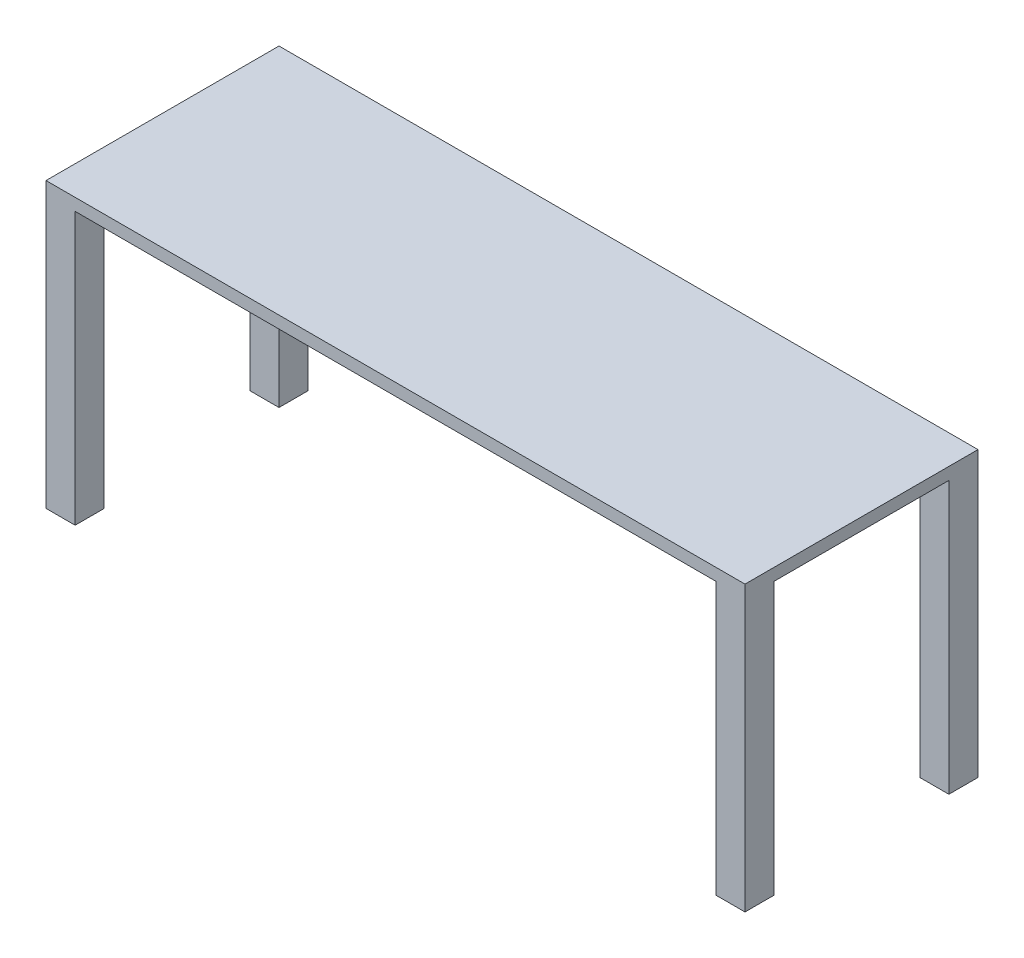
ISO-10303-21;
HEADER;
FILE_DESCRIPTION(('STEP AP214'),'2;1');
FILE_NAME('part.step','',(''),(''),'','','');
FILE_SCHEMA(('AUTOMOTIVE_DESIGN { 1 0 10303 214 1 1 1 1 }'));
ENDSEC;
DATA;
#1=APPLICATION_CONTEXT('core data for automotive mechanical design processes');
#2=APPLICATION_PROTOCOL_DEFINITION('international standard','automotive_design',2000,#1);
#3=PRODUCT_CONTEXT('',#1,'mechanical');
#4=PRODUCT('Part','Part','',(#3));
#5=PRODUCT_RELATED_PRODUCT_CATEGORY('part','',(#4));
#6=PRODUCT_DEFINITION_FORMATION('','',#4);
#7=PRODUCT_DEFINITION_CONTEXT('part definition',#1,'design');
#8=PRODUCT_DEFINITION('design','',#6,#7);
#9=PRODUCT_DEFINITION_SHAPE('','',#8);
#10=(LENGTH_UNIT() NAMED_UNIT(*) SI_UNIT(.MILLI.,.METRE.));
#11=(NAMED_UNIT(*) PLANE_ANGLE_UNIT() SI_UNIT($,.RADIAN.));
#12=(NAMED_UNIT(*) SI_UNIT($,.STERADIAN.) SOLID_ANGLE_UNIT());
#13=UNCERTAINTY_MEASURE_WITH_UNIT(LENGTH_MEASURE(1.E-05),#10,'distance_accuracy_value','');
#14=(GEOMETRIC_REPRESENTATION_CONTEXT(3) GLOBAL_UNCERTAINTY_ASSIGNED_CONTEXT((#13)) GLOBAL_UNIT_ASSIGNED_CONTEXT((#10,
#11,#12)) REPRESENTATION_CONTEXT('',''));
#15=CARTESIAN_POINT('',(0.,0.,0.));
#16=DIRECTION('',(0.,0.,1.));
#17=DIRECTION('',(1.,0.,0.));
#18=AXIS2_PLACEMENT_3D('',#15,#16,#17);
#19=CARTESIAN_POINT('',(0.,0.,0.));
#20=DIRECTION('',(0.,1.,0.));
#21=DIRECTION('',(0.,0.,1.));
#22=AXIS2_PLACEMENT_3D('',#19,#20,#21);
#23=PLANE('',#22);
#24=DIRECTION('',(-1.,0.,0.));
#25=VECTOR('',#24,1.);
#26=CARTESIAN_POINT('',(1828.8,0.,-533.399999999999));
#27=LINE('',#26,#25);
#28=CARTESIAN_POINT('',(1828.8,0.,-533.399999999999));
#29=VERTEX_POINT('',#28);
#30=CARTESIAN_POINT('',(1752.6,0.,-533.399999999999));
#31=VERTEX_POINT('',#30);
#32=EDGE_CURVE('E153',#29,#31,#27,.T.);
#33=ORIENTED_EDGE('',*,*,#32,.F.);
#34=DIRECTION('',(0.,0.,-1.));
#35=VECTOR('',#34,1.);
#36=CARTESIAN_POINT('',(1828.8,0.,-609.6));
#37=LINE('',#36,#35);
#38=CARTESIAN_POINT('',(1828.8,0.,-76.1999999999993));
#39=VERTEX_POINT('',#38);
#40=EDGE_CURVE('E162',#39,#29,#37,.T.);
#41=ORIENTED_EDGE('',*,*,#40,.F.);
#42=DIRECTION('',(-1.,0.,0.));
#43=VECTOR('',#42,1.);
#44=CARTESIAN_POINT('',(1828.8,0.,-76.199999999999));
#45=LINE('',#44,#43);
#46=CARTESIAN_POINT('',(1752.6,0.,-76.199999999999));
#47=VERTEX_POINT('',#46);
#48=EDGE_CURVE('E59',#39,#47,#45,.T.);
#49=ORIENTED_EDGE('',*,*,#48,.T.);
#50=DIRECTION('',(0.,0.,-1.));
#51=VECTOR('',#50,1.);
#52=CARTESIAN_POINT('',(1752.6,0.,9.15933995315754E-13));
#53=LINE('',#52,#51);
#54=CARTESIAN_POINT('',(1752.6,0.,9.15933995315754E-13));
#55=VERTEX_POINT('',#54);
#56=EDGE_CURVE('E203',#55,#47,#53,.T.);
#57=ORIENTED_EDGE('',*,*,#56,.F.);
#58=DIRECTION('',(1.,0.,0.));
#59=VECTOR('',#58,1.);
#60=CARTESIAN_POINT('',(0.,0.,0.));
#61=LINE('',#60,#59);
#62=CARTESIAN_POINT('',(76.2,0.,0.));
#63=VERTEX_POINT('',#62);
#64=EDGE_CURVE('E170',#63,#55,#61,.T.);
#65=ORIENTED_EDGE('',*,*,#64,.F.);
#66=DIRECTION('',(0.,0.,-1.));
#67=VECTOR('',#66,1.);
#68=CARTESIAN_POINT('',(76.2,0.,0.));
#69=LINE('',#68,#67);
#70=CARTESIAN_POINT('',(76.2,0.,-76.2));
#71=VERTEX_POINT('',#70);
#72=EDGE_CURVE('E237',#63,#71,#69,.T.);
#73=ORIENTED_EDGE('',*,*,#72,.T.);
#74=DIRECTION('',(1.,0.,0.));
#75=VECTOR('',#74,1.);
#76=CARTESIAN_POINT('',(0.,0.,-76.2));
#77=LINE('',#76,#75);
#78=CARTESIAN_POINT('',(0.,0.,-76.2));
#79=VERTEX_POINT('',#78);
#80=EDGE_CURVE('E225',#79,#71,#77,.T.);
#81=ORIENTED_EDGE('',*,*,#80,.F.);
#82=DIRECTION('',(0.,0.,1.));
#83=VECTOR('',#82,1.);
#84=CARTESIAN_POINT('',(0.,0.,-609.6));
#85=LINE('',#84,#83);
#86=CARTESIAN_POINT('',(0.,0.,-533.4));
#87=VERTEX_POINT('',#86);
#88=EDGE_CURVE('E175',#87,#79,#85,.T.);
#89=ORIENTED_EDGE('',*,*,#88,.F.);
#90=DIRECTION('',(1.,0.,0.));
#91=VECTOR('',#90,1.);
#92=CARTESIAN_POINT('',(0.,0.,-533.4));
#93=LINE('',#92,#91);
#94=CARTESIAN_POINT('',(76.2,0.,-533.4));
#95=VERTEX_POINT('',#94);
#96=EDGE_CURVE('E221',#87,#95,#93,.T.);
#97=ORIENTED_EDGE('',*,*,#96,.T.);
#98=DIRECTION('',(0.,0.,1.));
#99=VECTOR('',#98,1.);
#100=CARTESIAN_POINT('',(76.2,0.,-609.6));
#101=LINE('',#100,#99);
#102=CARTESIAN_POINT('',(76.2,0.,-609.6));
#103=VERTEX_POINT('',#102);
#104=EDGE_CURVE('E218',#103,#95,#101,.T.);
#105=ORIENTED_EDGE('',*,*,#104,.F.);
#106=DIRECTION('',(-1.,0.,0.));
#107=VECTOR('',#106,1.);
#108=CARTESIAN_POINT('',(0.,0.,-609.6));
#109=LINE('',#108,#107);
#110=CARTESIAN_POINT('',(1752.6,0.,-609.6));
#111=VERTEX_POINT('',#110);
#112=EDGE_CURVE('E169',#111,#103,#109,.T.);
#113=ORIENTED_EDGE('',*,*,#112,.F.);
#114=DIRECTION('',(0.,0.,1.));
#115=VECTOR('',#114,1.);
#116=CARTESIAN_POINT('',(1752.6,0.,-609.599999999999));
#117=LINE('',#116,#115);
#118=EDGE_CURVE('E51',#111,#31,#117,.T.);
#119=ORIENTED_EDGE('',*,*,#118,.T.);
#120=EDGE_LOOP('',(#33,#41,#49,#57,#65,#73,#81,#89,#97,#105,#113,#119));
#121=FACE_BOUND('',#120,.T.);
#122=ADVANCED_FACE('F36',(#121),#23,.F.);
#123=CARTESIAN_POINT('',(0.,31.75,-609.6));
#124=DIRECTION('',(1.,0.,0.));
#125=DIRECTION('',(0.,0.,-1.));
#126=AXIS2_PLACEMENT_3D('',#123,#124,#125);
#127=PLANE('',#126);
#128=DIRECTION('',(0.,-1.,0.));
#129=VECTOR('',#128,1.);
#130=CARTESIAN_POINT('',(0.,31.75,-609.6));
#131=LINE('',#130,#129);
#132=CARTESIAN_POINT('',(0.,31.75,-609.6));
#133=VERTEX_POINT('',#132);
#134=CARTESIAN_POINT('',(0.,-711.2,-609.6));
#135=VERTEX_POINT('',#134);
#136=EDGE_CURVE('E179',#133,#135,#131,.T.);
#137=ORIENTED_EDGE('',*,*,#136,.T.);
#138=DIRECTION('',(0.,0.,1.));
#139=VECTOR('',#138,1.);
#140=CARTESIAN_POINT('',(0.,-711.2,-609.6));
#141=LINE('',#140,#139);
#142=CARTESIAN_POINT('',(0.,-711.2,-533.4));
#143=VERTEX_POINT('',#142);
#144=EDGE_CURVE('E222',#135,#143,#141,.T.);
#145=ORIENTED_EDGE('',*,*,#144,.T.);
#146=DIRECTION('',(0.,1.,0.));
#147=VECTOR('',#146,1.);
#148=CARTESIAN_POINT('',(0.,-711.2,-533.4));
#149=LINE('',#148,#147);
#150=EDGE_CURVE('E210',#143,#87,#149,.T.);
#151=ORIENTED_EDGE('',*,*,#150,.T.);
#152=ORIENTED_EDGE('',*,*,#88,.T.);
#153=DIRECTION('',(0.,1.,0.));
#154=VECTOR('',#153,1.);
#155=CARTESIAN_POINT('',(0.,-711.2,-76.2));
#156=LINE('',#155,#154);
#157=CARTESIAN_POINT('',(0.,-711.2,-76.2));
#158=VERTEX_POINT('',#157);
#159=EDGE_CURVE('E245',#158,#79,#156,.T.);
#160=ORIENTED_EDGE('',*,*,#159,.F.);
#161=DIRECTION('',(0.,0.,-1.));
#162=VECTOR('',#161,1.);
#163=CARTESIAN_POINT('',(0.,-711.2,0.));
#164=LINE('',#163,#162);
#165=CARTESIAN_POINT('',(0.,-711.2,0.));
#166=VERTEX_POINT('',#165);
#167=EDGE_CURVE('E243',#166,#158,#164,.T.);
#168=ORIENTED_EDGE('',*,*,#167,.F.);
#169=DIRECTION('',(0.,-1.,0.));
#170=VECTOR('',#169,1.);
#171=CARTESIAN_POINT('',(0.,31.75,0.));
#172=LINE('',#171,#170);
#173=CARTESIAN_POINT('',(0.,31.75,0.));
#174=VERTEX_POINT('',#173);
#175=EDGE_CURVE('E11',#174,#166,#172,.T.);
#176=ORIENTED_EDGE('',*,*,#175,.F.);
#177=DIRECTION('',(0.,0.,1.));
#178=VECTOR('',#177,1.);
#179=CARTESIAN_POINT('',(0.,31.75,-609.6));
#180=LINE('',#179,#178);
#181=EDGE_CURVE('E172',#133,#174,#180,.T.);
#182=ORIENTED_EDGE('',*,*,#181,.F.);
#183=EDGE_LOOP('',(#137,#145,#151,#152,#160,#168,#176,#182));
#184=FACE_BOUND('',#183,.T.);
#185=ADVANCED_FACE('F38',(#184),#127,.F.);
#186=CARTESIAN_POINT('',(0.,31.75,0.));
#187=DIRECTION('',(0.,0.,-1.));
#188=DIRECTION('',(-1.,0.,0.));
#189=AXIS2_PLACEMENT_3D('',#186,#187,#188);
#190=PLANE('',#189);
#191=ORIENTED_EDGE('',*,*,#175,.T.);
#192=DIRECTION('',(1.,0.,0.));
#193=VECTOR('',#192,1.);
#194=CARTESIAN_POINT('',(0.,-711.2,0.));
#195=LINE('',#194,#193);
#196=CARTESIAN_POINT('',(76.2,-711.2,0.));
#197=VERTEX_POINT('',#196);
#198=EDGE_CURVE('E240',#166,#197,#195,.T.);
#199=ORIENTED_EDGE('',*,*,#198,.T.);
#200=DIRECTION('',(0.,1.,0.));
#201=VECTOR('',#200,1.);
#202=CARTESIAN_POINT('',(76.2,-711.2,0.));
#203=LINE('',#202,#201);
#204=EDGE_CURVE('E251',#197,#63,#203,.T.);
#205=ORIENTED_EDGE('',*,*,#204,.T.);
#206=ORIENTED_EDGE('',*,*,#64,.T.);
#207=DIRECTION('',(0.,1.,0.));
#208=VECTOR('',#207,1.);
#209=CARTESIAN_POINT('',(1752.6,-711.2,9.15933995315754E-13));
#210=LINE('',#209,#208);
#211=CARTESIAN_POINT('',(1752.6,-711.2,9.15933995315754E-13));
#212=VERTEX_POINT('',#211);
#213=EDGE_CURVE('E194',#212,#55,#210,.T.);
#214=ORIENTED_EDGE('',*,*,#213,.F.);
#215=DIRECTION('',(-1.,0.,0.));
#216=VECTOR('',#215,1.);
#217=CARTESIAN_POINT('',(1828.8,-711.2,9.9920072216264E-13));
#218=LINE('',#217,#216);
#219=CARTESIAN_POINT('',(1828.8,-711.2,9.9920072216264E-13));
#220=VERTEX_POINT('',#219);
#221=EDGE_CURVE('E192',#220,#212,#218,.T.);
#222=ORIENTED_EDGE('',*,*,#221,.F.);
#223=DIRECTION('',(0.,-1.,0.));
#224=VECTOR('',#223,1.);
#225=CARTESIAN_POINT('',(1828.8,31.75,0.));
#226=LINE('',#225,#224);
#227=CARTESIAN_POINT('',(1828.8,31.75,0.));
#228=VERTEX_POINT('',#227);
#229=EDGE_CURVE('E44',#228,#220,#226,.T.);
#230=ORIENTED_EDGE('',*,*,#229,.F.);
#231=DIRECTION('',(1.,0.,0.));
#232=VECTOR('',#231,1.);
#233=CARTESIAN_POINT('',(0.,31.75,0.));
#234=LINE('',#233,#232);
#235=EDGE_CURVE('E258',#174,#228,#234,.T.);
#236=ORIENTED_EDGE('',*,*,#235,.F.);
#237=EDGE_LOOP('',(#191,#199,#205,#206,#214,#222,#230,#236));
#238=FACE_BOUND('',#237,.T.);
#239=ADVANCED_FACE('F193',(#238),#190,.F.);
#240=CARTESIAN_POINT('',(1828.8,31.75,-609.6));
#241=DIRECTION('',(-1.,0.,0.));
#242=DIRECTION('',(0.,0.,1.));
#243=AXIS2_PLACEMENT_3D('',#240,#241,#242);
#244=PLANE('',#243);
#245=ORIENTED_EDGE('',*,*,#229,.T.);
#246=DIRECTION('',(0.,0.,-1.));
#247=VECTOR('',#246,1.);
#248=CARTESIAN_POINT('',(1828.8,-711.2,9.9920072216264E-13));
#249=LINE('',#248,#247);
#250=CARTESIAN_POINT('',(1828.8,-711.2,-76.199999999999));
#251=VERTEX_POINT('',#250);
#252=EDGE_CURVE('E187',#220,#251,#249,.T.);
#253=ORIENTED_EDGE('',*,*,#252,.T.);
#254=DIRECTION('',(0.,1.,0.));
#255=VECTOR('',#254,1.);
#256=CARTESIAN_POINT('',(1828.8,-711.2,-76.199999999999));
#257=LINE('',#256,#255);
#258=EDGE_CURVE('E168',#251,#39,#257,.T.);
#259=ORIENTED_EDGE('',*,*,#258,.T.);
#260=ORIENTED_EDGE('',*,*,#40,.T.);
#261=DIRECTION('',(0.,1.,0.));
#262=VECTOR('',#261,1.);
#263=CARTESIAN_POINT('',(1828.8,-711.2,-533.399999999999));
#264=LINE('',#263,#262);
#265=CARTESIAN_POINT('',(1828.8,-711.2,-533.399999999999));
#266=VERTEX_POINT('',#265);
#267=EDGE_CURVE('E149',#266,#29,#264,.T.);
#268=ORIENTED_EDGE('',*,*,#267,.F.);
#269=DIRECTION('',(0.,0.,1.));
#270=VECTOR('',#269,1.);
#271=CARTESIAN_POINT('',(1828.8,-711.2,-609.599999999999));
#272=LINE('',#271,#270);
#273=CARTESIAN_POINT('',(1828.8,-711.2,-609.599999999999));
#274=VERTEX_POINT('',#273);
#275=EDGE_CURVE('E432',#274,#266,#272,.T.);
#276=ORIENTED_EDGE('',*,*,#275,.F.);
#277=DIRECTION('',(0.,-1.,0.));
#278=VECTOR('',#277,1.);
#279=CARTESIAN_POINT('',(1828.8,31.75,-609.6));
#280=LINE('',#279,#278);
#281=CARTESIAN_POINT('',(1828.8,31.75,-609.6));
#282=VERTEX_POINT('',#281);
#283=EDGE_CURVE('E181',#282,#274,#280,.T.);
#284=ORIENTED_EDGE('',*,*,#283,.F.);
#285=DIRECTION('',(0.,0.,-1.));
#286=VECTOR('',#285,1.);
#287=CARTESIAN_POINT('',(1828.8,31.75,-609.6));
#288=LINE('',#287,#286);
#289=EDGE_CURVE('E189',#228,#282,#288,.T.);
#290=ORIENTED_EDGE('',*,*,#289,.F.);
#291=EDGE_LOOP('',(#245,#253,#259,#260,#268,#276,#284,#290));
#292=FACE_BOUND('',#291,.T.);
#293=ADVANCED_FACE('F166',(#292),#244,.F.);
#294=CARTESIAN_POINT('',(0.,31.75,-609.6));
#295=DIRECTION('',(0.,0.,1.));
#296=DIRECTION('',(1.,0.,0.));
#297=AXIS2_PLACEMENT_3D('',#294,#295,#296);
#298=PLANE('',#297);
#299=ORIENTED_EDGE('',*,*,#283,.T.);
#300=DIRECTION('',(-1.,0.,0.));
#301=VECTOR('',#300,1.);
#302=CARTESIAN_POINT('',(1828.8,-711.2,-609.599999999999));
#303=LINE('',#302,#301);
#304=CARTESIAN_POINT('',(1752.6,-711.2,-609.599999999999));
#305=VERTEX_POINT('',#304);
#306=EDGE_CURVE('E164',#274,#305,#303,.T.);
#307=ORIENTED_EDGE('',*,*,#306,.T.);
#308=DIRECTION('',(0.,1.,0.));
#309=VECTOR('',#308,1.);
#310=CARTESIAN_POINT('',(1752.6,-711.2,-609.599999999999));
#311=LINE('',#310,#309);
#312=EDGE_CURVE('E446',#305,#111,#311,.T.);
#313=ORIENTED_EDGE('',*,*,#312,.T.);
#314=ORIENTED_EDGE('',*,*,#112,.T.);
#315=DIRECTION('',(0.,1.,0.));
#316=VECTOR('',#315,1.);
#317=CARTESIAN_POINT('',(76.2,-711.2,-609.6));
#318=LINE('',#317,#316);
#319=CARTESIAN_POINT('',(76.2,-711.2,-609.6));
#320=VERTEX_POINT('',#319);
#321=EDGE_CURVE('E215',#320,#103,#318,.T.);
#322=ORIENTED_EDGE('',*,*,#321,.F.);
#323=DIRECTION('',(1.,0.,0.));
#324=VECTOR('',#323,1.);
#325=CARTESIAN_POINT('',(0.,-711.2,-609.6));
#326=LINE('',#325,#324);
#327=EDGE_CURVE('E212',#135,#320,#326,.T.);
#328=ORIENTED_EDGE('',*,*,#327,.F.);
#329=ORIENTED_EDGE('',*,*,#136,.F.);
#330=DIRECTION('',(-1.,0.,0.));
#331=VECTOR('',#330,1.);
#332=CARTESIAN_POINT('',(0.,31.75,-609.6));
#333=LINE('',#332,#331);
#334=EDGE_CURVE('E182',#282,#133,#333,.T.);
#335=ORIENTED_EDGE('',*,*,#334,.F.);
#336=EDGE_LOOP('',(#299,#307,#313,#314,#322,#328,#329,#335));
#337=FACE_BOUND('',#336,.T.);
#338=ADVANCED_FACE('F288',(#337),#298,.F.);
#339=CARTESIAN_POINT('',(0.,31.75,0.));
#340=DIRECTION('',(0.,1.,0.));
#341=DIRECTION('',(0.,0.,1.));
#342=AXIS2_PLACEMENT_3D('',#339,#340,#341);
#343=PLANE('',#342);
#344=ORIENTED_EDGE('',*,*,#181,.T.);
#345=ORIENTED_EDGE('',*,*,#235,.T.);
#346=ORIENTED_EDGE('',*,*,#289,.T.);
#347=ORIENTED_EDGE('',*,*,#334,.T.);
#348=EDGE_LOOP('',(#344,#345,#346,#347));
#349=FACE_BOUND('',#348,.T.);
#350=ADVANCED_FACE('F285',(#349),#343,.T.);
#351=CARTESIAN_POINT('',(0.,-711.2,-76.2));
#352=DIRECTION('',(0.,0.,1.));
#353=DIRECTION('',(1.,0.,0.));
#354=AXIS2_PLACEMENT_3D('',#351,#352,#353);
#355=PLANE('',#354);
#356=ORIENTED_EDGE('',*,*,#80,.T.);
#357=DIRECTION('',(0.,1.,0.));
#358=VECTOR('',#357,1.);
#359=CARTESIAN_POINT('',(76.2,-711.2,-76.2));
#360=LINE('',#359,#358);
#361=CARTESIAN_POINT('',(76.2,-711.2,-76.2));
#362=VERTEX_POINT('',#361);
#363=EDGE_CURVE('E253',#362,#71,#360,.T.);
#364=ORIENTED_EDGE('',*,*,#363,.F.);
#365=DIRECTION('',(1.,0.,0.));
#366=VECTOR('',#365,1.);
#367=CARTESIAN_POINT('',(0.,-711.2,-76.2));
#368=LINE('',#367,#366);
#369=EDGE_CURVE('E234',#158,#362,#368,.T.);
#370=ORIENTED_EDGE('',*,*,#369,.F.);
#371=ORIENTED_EDGE('',*,*,#159,.T.);
#372=EDGE_LOOP('',(#356,#364,#370,#371));
#373=FACE_BOUND('',#372,.T.);
#374=ADVANCED_FACE('F269',(#373),#355,.F.);
#375=CARTESIAN_POINT('',(76.2,-711.2,0.));
#376=DIRECTION('',(1.,0.,0.));
#377=DIRECTION('',(0.,0.,-1.));
#378=AXIS2_PLACEMENT_3D('',#375,#376,#377);
#379=PLANE('',#378);
#380=ORIENTED_EDGE('',*,*,#72,.F.);
#381=ORIENTED_EDGE('',*,*,#204,.F.);
#382=DIRECTION('',(0.,0.,-1.));
#383=VECTOR('',#382,1.);
#384=CARTESIAN_POINT('',(76.2,-711.2,0.));
#385=LINE('',#384,#383);
#386=EDGE_CURVE('E236',#197,#362,#385,.T.);
#387=ORIENTED_EDGE('',*,*,#386,.T.);
#388=ORIENTED_EDGE('',*,*,#363,.T.);
#389=EDGE_LOOP('',(#380,#381,#387,#388));
#390=FACE_BOUND('',#389,.T.);
#391=ADVANCED_FACE('F275',(#390),#379,.T.);
#392=CARTESIAN_POINT('',(0.,-711.2,0.));
#393=DIRECTION('',(0.,1.,0.));
#394=DIRECTION('',(0.,0.,1.));
#395=AXIS2_PLACEMENT_3D('',#392,#393,#394);
#396=PLANE('',#395);
#397=ORIENTED_EDGE('',*,*,#369,.T.);
#398=ORIENTED_EDGE('',*,*,#386,.F.);
#399=ORIENTED_EDGE('',*,*,#198,.F.);
#400=ORIENTED_EDGE('',*,*,#167,.T.);
#401=EDGE_LOOP('',(#397,#398,#399,#400));
#402=FACE_BOUND('',#401,.T.);
#403=ADVANCED_FACE('F279',(#402),#396,.F.);
#404=CARTESIAN_POINT('',(76.2,-711.2,-609.6));
#405=DIRECTION('',(-1.,0.,0.));
#406=DIRECTION('',(0.,0.,1.));
#407=AXIS2_PLACEMENT_3D('',#404,#405,#406);
#408=PLANE('',#407);
#409=ORIENTED_EDGE('',*,*,#104,.T.);
#410=DIRECTION('',(0.,1.,0.));
#411=VECTOR('',#410,1.);
#412=CARTESIAN_POINT('',(76.2,-711.2,-533.4));
#413=LINE('',#412,#411);
#414=CARTESIAN_POINT('',(76.2,-711.2,-533.4));
#415=VERTEX_POINT('',#414);
#416=EDGE_CURVE('E213',#415,#95,#413,.T.);
#417=ORIENTED_EDGE('',*,*,#416,.F.);
#418=DIRECTION('',(0.,0.,1.));
#419=VECTOR('',#418,1.);
#420=CARTESIAN_POINT('',(76.2,-711.2,-609.6));
#421=LINE('',#420,#419);
#422=EDGE_CURVE('E227',#320,#415,#421,.T.);
#423=ORIENTED_EDGE('',*,*,#422,.F.);
#424=ORIENTED_EDGE('',*,*,#321,.T.);
#425=EDGE_LOOP('',(#409,#417,#423,#424));
#426=FACE_BOUND('',#425,.T.);
#427=ADVANCED_FACE('F300',(#426),#408,.F.);
#428=CARTESIAN_POINT('',(0.,-711.2,-533.4));
#429=DIRECTION('',(0.,0.,1.));
#430=DIRECTION('',(1.,0.,0.));
#431=AXIS2_PLACEMENT_3D('',#428,#429,#430);
#432=PLANE('',#431);
#433=ORIENTED_EDGE('',*,*,#96,.F.);
#434=ORIENTED_EDGE('',*,*,#150,.F.);
#435=DIRECTION('',(1.,0.,0.));
#436=VECTOR('',#435,1.);
#437=CARTESIAN_POINT('',(0.,-711.2,-533.4));
#438=LINE('',#437,#436);
#439=EDGE_CURVE('E229',#143,#415,#438,.T.);
#440=ORIENTED_EDGE('',*,*,#439,.T.);
#441=ORIENTED_EDGE('',*,*,#416,.T.);
#442=EDGE_LOOP('',(#433,#434,#440,#441));
#443=FACE_BOUND('',#442,.T.);
#444=ADVANCED_FACE('F297',(#443),#432,.T.);
#445=CARTESIAN_POINT('',(0.,-711.2,0.));
#446=DIRECTION('',(0.,1.,0.));
#447=DIRECTION('',(0.,0.,1.));
#448=AXIS2_PLACEMENT_3D('',#445,#446,#447);
#449=PLANE('',#448);
#450=ORIENTED_EDGE('',*,*,#144,.F.);
#451=ORIENTED_EDGE('',*,*,#327,.T.);
#452=ORIENTED_EDGE('',*,*,#422,.T.);
#453=ORIENTED_EDGE('',*,*,#439,.F.);
#454=EDGE_LOOP('',(#450,#451,#452,#453));
#455=FACE_BOUND('',#454,.T.);
#456=ADVANCED_FACE('F294',(#455),#449,.F.);
#457=CARTESIAN_POINT('',(1752.6,-711.2,9.15933995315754E-13));
#458=DIRECTION('',(1.,0.,0.));
#459=DIRECTION('',(0.,0.,-1.));
#460=AXIS2_PLACEMENT_3D('',#457,#458,#459);
#461=PLANE('',#460);
#462=ORIENTED_EDGE('',*,*,#56,.T.);
#463=DIRECTION('',(0.,1.,0.));
#464=VECTOR('',#463,1.);
#465=CARTESIAN_POINT('',(1752.6,-711.2,-76.199999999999));
#466=LINE('',#465,#464);
#467=CARTESIAN_POINT('',(1752.6,-711.2,-76.199999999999));
#468=VERTEX_POINT('',#467);
#469=EDGE_CURVE('E440',#468,#47,#466,.T.);
#470=ORIENTED_EDGE('',*,*,#469,.F.);
#471=DIRECTION('',(0.,0.,-1.));
#472=VECTOR('',#471,1.);
#473=CARTESIAN_POINT('',(1752.6,-711.2,9.15933995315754E-13));
#474=LINE('',#473,#472);
#475=EDGE_CURVE('E197',#212,#468,#474,.T.);
#476=ORIENTED_EDGE('',*,*,#475,.F.);
#477=ORIENTED_EDGE('',*,*,#213,.T.);
#478=EDGE_LOOP('',(#462,#470,#476,#477));
#479=FACE_BOUND('',#478,.T.);
#480=ADVANCED_FACE('F373',(#479),#461,.F.);
#481=CARTESIAN_POINT('',(1828.8,-711.2,-76.199999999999));
#482=DIRECTION('',(0.,0.,-1.));
#483=DIRECTION('',(-1.,0.,0.));
#484=AXIS2_PLACEMENT_3D('',#481,#482,#483);
#485=PLANE('',#484);
#486=ORIENTED_EDGE('',*,*,#48,.F.);
#487=ORIENTED_EDGE('',*,*,#258,.F.);
#488=DIRECTION('',(-1.,0.,0.));
#489=VECTOR('',#488,1.);
#490=CARTESIAN_POINT('',(1828.8,-711.2,-76.199999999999));
#491=LINE('',#490,#489);
#492=EDGE_CURVE('E202',#251,#468,#491,.T.);
#493=ORIENTED_EDGE('',*,*,#492,.T.);
#494=ORIENTED_EDGE('',*,*,#469,.T.);
#495=EDGE_LOOP('',(#486,#487,#493,#494));
#496=FACE_BOUND('',#495,.T.);
#497=ADVANCED_FACE('F381',(#496),#485,.T.);
#498=CARTESIAN_POINT('',(0.,-711.2,0.));
#499=DIRECTION('',(0.,1.,0.));
#500=DIRECTION('',(0.,0.,1.));
#501=AXIS2_PLACEMENT_3D('',#498,#499,#500);
#502=PLANE('',#501);
#503=ORIENTED_EDGE('',*,*,#252,.F.);
#504=ORIENTED_EDGE('',*,*,#221,.T.);
#505=ORIENTED_EDGE('',*,*,#475,.T.);
#506=ORIENTED_EDGE('',*,*,#492,.F.);
#507=EDGE_LOOP('',(#503,#504,#505,#506));
#508=FACE_BOUND('',#507,.T.);
#509=ADVANCED_FACE('F200',(#508),#502,.F.);
#510=CARTESIAN_POINT('',(1828.8,-711.2,-533.399999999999));
#511=DIRECTION('',(0.,0.,-1.));
#512=DIRECTION('',(-1.,0.,0.));
#513=AXIS2_PLACEMENT_3D('',#510,#511,#512);
#514=PLANE('',#513);
#515=ORIENTED_EDGE('',*,*,#32,.T.);
#516=DIRECTION('',(0.,1.,0.));
#517=VECTOR('',#516,1.);
#518=CARTESIAN_POINT('',(1752.6,-711.2,-533.399999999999));
#519=LINE('',#518,#517);
#520=CARTESIAN_POINT('',(1752.6,-711.2,-533.399999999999));
#521=VERTEX_POINT('',#520);
#522=EDGE_CURVE('E158',#521,#31,#519,.T.);
#523=ORIENTED_EDGE('',*,*,#522,.F.);
#524=DIRECTION('',(-1.,0.,0.));
#525=VECTOR('',#524,1.);
#526=CARTESIAN_POINT('',(1828.8,-711.2,-533.399999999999));
#527=LINE('',#526,#525);
#528=EDGE_CURVE('E154',#266,#521,#527,.T.);
#529=ORIENTED_EDGE('',*,*,#528,.F.);
#530=ORIENTED_EDGE('',*,*,#267,.T.);
#531=EDGE_LOOP('',(#515,#523,#529,#530));
#532=FACE_BOUND('',#531,.T.);
#533=ADVANCED_FACE('F151',(#532),#514,.F.);
#534=CARTESIAN_POINT('',(1752.6,-711.2,-609.599999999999));
#535=DIRECTION('',(-1.,0.,0.));
#536=DIRECTION('',(0.,0.,1.));
#537=AXIS2_PLACEMENT_3D('',#534,#535,#536);
#538=PLANE('',#537);
#539=ORIENTED_EDGE('',*,*,#118,.F.);
#540=ORIENTED_EDGE('',*,*,#312,.F.);
#541=DIRECTION('',(0.,0.,1.));
#542=VECTOR('',#541,1.);
#543=CARTESIAN_POINT('',(1752.6,-711.2,-609.599999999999));
#544=LINE('',#543,#542);
#545=EDGE_CURVE('E434',#305,#521,#544,.T.);
#546=ORIENTED_EDGE('',*,*,#545,.T.);
#547=ORIENTED_EDGE('',*,*,#522,.T.);
#548=EDGE_LOOP('',(#539,#540,#546,#547));
#549=FACE_BOUND('',#548,.T.);
#550=ADVANCED_FACE('F407',(#549),#538,.T.);
#551=CARTESIAN_POINT('',(0.,-711.2,0.));
#552=DIRECTION('',(0.,1.,0.));
#553=DIRECTION('',(0.,0.,1.));
#554=AXIS2_PLACEMENT_3D('',#551,#552,#553);
#555=PLANE('',#554);
#556=ORIENTED_EDGE('',*,*,#306,.F.);
#557=ORIENTED_EDGE('',*,*,#275,.T.);
#558=ORIENTED_EDGE('',*,*,#528,.T.);
#559=ORIENTED_EDGE('',*,*,#545,.F.);
#560=EDGE_LOOP('',(#556,#557,#558,#559));
#561=FACE_BOUND('',#560,.T.);
#562=ADVANCED_FACE('F416',(#561),#555,.F.);
#563=CLOSED_SHELL('',(#122,#185,#239,#293,#338,#350,#374,#391,#403,#427,#444,#456,#480,#497,
#509,#533,#550,#562));
#564=MANIFOLD_SOLID_BREP('B2',#563);
#565=ADVANCED_BREP_SHAPE_REPRESENTATION('',(#18,#564),#14);
#566=SHAPE_DEFINITION_REPRESENTATION(#9,#565);
ENDSEC;
END-ISO-10303-21;
